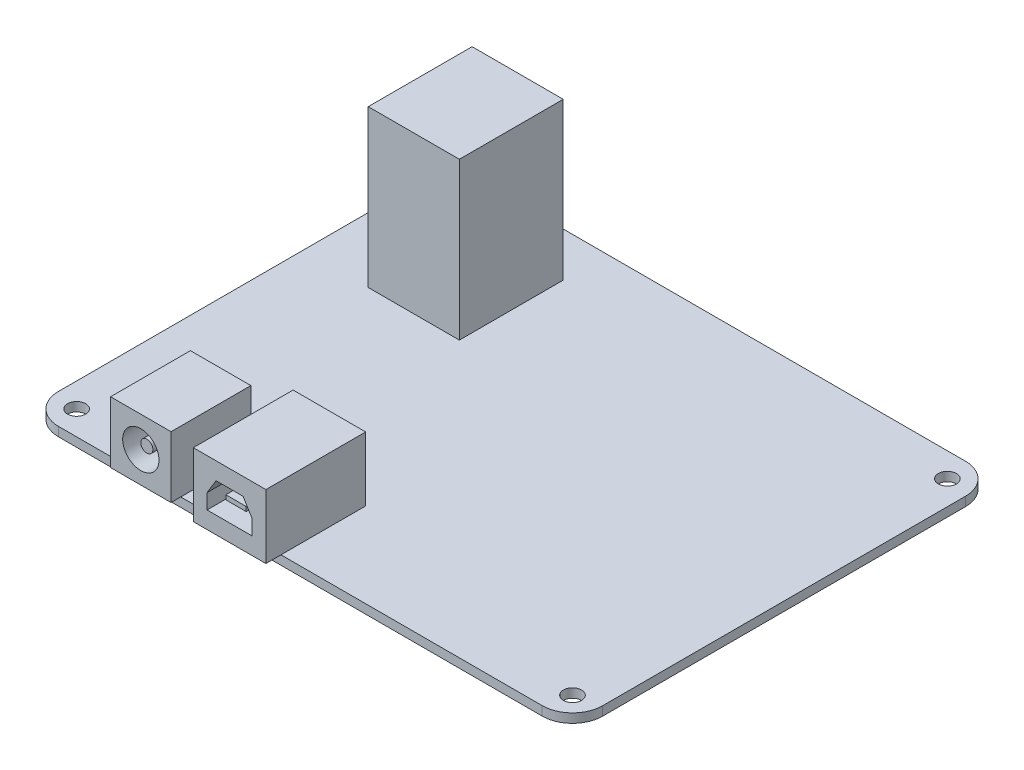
ISO-10303-21;
HEADER;
FILE_DESCRIPTION(('STEP AP214'),'2;1');
FILE_NAME('part.step','',(''),(''),'','','');
FILE_SCHEMA(('AUTOMOTIVE_DESIGN { 1 0 10303 214 1 1 1 1 }'));
ENDSEC;
DATA;
#1=APPLICATION_CONTEXT('core data for automotive mechanical design processes');
#2=APPLICATION_PROTOCOL_DEFINITION('international standard','automotive_design',2000,#1);
#3=PRODUCT_CONTEXT('',#1,'mechanical');
#4=PRODUCT('Part','Part','',(#3));
#5=PRODUCT_RELATED_PRODUCT_CATEGORY('part','',(#4));
#6=PRODUCT_DEFINITION_FORMATION('','',#4);
#7=PRODUCT_DEFINITION_CONTEXT('part definition',#1,'design');
#8=PRODUCT_DEFINITION('design','',#6,#7);
#9=PRODUCT_DEFINITION_SHAPE('','',#8);
#10=(LENGTH_UNIT() NAMED_UNIT(*) SI_UNIT(.MILLI.,.METRE.));
#11=(NAMED_UNIT(*) PLANE_ANGLE_UNIT() SI_UNIT($,.RADIAN.));
#12=(NAMED_UNIT(*) SI_UNIT($,.STERADIAN.) SOLID_ANGLE_UNIT());
#13=UNCERTAINTY_MEASURE_WITH_UNIT(LENGTH_MEASURE(1.E-05),#10,'distance_accuracy_value','');
#14=(GEOMETRIC_REPRESENTATION_CONTEXT(3) GLOBAL_UNCERTAINTY_ASSIGNED_CONTEXT((#13)) GLOBAL_UNIT_ASSIGNED_CONTEXT((#10,
#11,#12)) REPRESENTATION_CONTEXT('',''));
#15=CARTESIAN_POINT('',(0.,0.,0.));
#16=DIRECTION('',(0.,0.,1.));
#17=DIRECTION('',(1.,0.,0.));
#18=AXIS2_PLACEMENT_3D('',#15,#16,#17);
#19=CARTESIAN_POINT('',(0.,1.5,0.));
#20=DIRECTION('',(0.,1.,0.));
#21=DIRECTION('',(0.,0.,1.));
#22=AXIS2_PLACEMENT_3D('',#19,#20,#21);
#23=PLANE('',#22);
#24=CARTESIAN_POINT('',(41.,1.5,31.));
#25=DIRECTION('',(0.,1.,0.));
#26=DIRECTION('',(0.,0.,-1.));
#27=AXIS2_PLACEMENT_3D('',#24,#25,#26);
#28=CIRCLE('',#27,1.5);
#29=CARTESIAN_POINT('',(41.,1.5,29.5));
#30=VERTEX_POINT('',#29);
#31=EDGE_CURVE('E429',#30,#30,#28,.T.);
#32=ORIENTED_EDGE('',*,*,#31,.F.);
#33=EDGE_LOOP('',(#32));
#34=FACE_BOUND('',#33,.T.);
#35=CARTESIAN_POINT('',(41.,1.5,-31.));
#36=DIRECTION('',(0.,-1.,0.));
#37=DIRECTION('',(0.,0.,1.));
#38=AXIS2_PLACEMENT_3D('',#35,#36,#37);
#39=CIRCLE('',#38,1.5);
#40=CARTESIAN_POINT('',(41.,1.5,-29.5));
#41=VERTEX_POINT('',#40);
#42=EDGE_CURVE('E433',#41,#41,#39,.T.);
#43=ORIENTED_EDGE('',*,*,#42,.T.);
#44=EDGE_LOOP('',(#43));
#45=FACE_BOUND('',#44,.T.);
#46=CARTESIAN_POINT('',(-41.,1.5,31.));
#47=DIRECTION('',(0.,-1.,0.));
#48=DIRECTION('',(0.,0.,-1.));
#49=AXIS2_PLACEMENT_3D('',#46,#47,#48);
#50=CIRCLE('',#49,1.5);
#51=CARTESIAN_POINT('',(-41.,1.5,29.5));
#52=VERTEX_POINT('',#51);
#53=EDGE_CURVE('E439',#52,#52,#50,.T.);
#54=ORIENTED_EDGE('',*,*,#53,.T.);
#55=EDGE_LOOP('',(#54));
#56=FACE_BOUND('',#55,.T.);
#57=CARTESIAN_POINT('',(-41.,1.5,-31.));
#58=DIRECTION('',(0.,1.,0.));
#59=DIRECTION('',(0.,0.,1.));
#60=AXIS2_PLACEMENT_3D('',#57,#58,#59);
#61=CIRCLE('',#60,1.5);
#62=CARTESIAN_POINT('',(-41.,1.5,-29.5));
#63=VERTEX_POINT('',#62);
#64=EDGE_CURVE('E445',#63,#63,#61,.T.);
#65=ORIENTED_EDGE('',*,*,#64,.F.);
#66=EDGE_LOOP('',(#65));
#67=FACE_BOUND('',#66,.T.);
#68=DIRECTION('',(1.,0.,0.));
#69=VECTOR('',#68,1.);
#70=CARTESIAN_POINT('',(-45.,1.5,35.));
#71=LINE('',#70,#69);
#72=CARTESIAN_POINT('',(-19.78,1.5,35.));
#73=VERTEX_POINT('',#72);
#74=CARTESIAN_POINT('',(-15.2,1.5,35.));
#75=VERTEX_POINT('',#74);
#76=EDGE_CURVE('E543',#73,#75,#71,.T.);
#77=ORIENTED_EDGE('',*,*,#76,.T.);
#78=DIRECTION('',(0.,0.,1.));
#79=VECTOR('',#78,1.);
#80=CARTESIAN_POINT('',(-15.2,1.5,21.));
#81=LINE('',#80,#79);
#82=CARTESIAN_POINT('',(-15.2,1.5,21.));
#83=VERTEX_POINT('',#82);
#84=EDGE_CURVE('E365',#83,#75,#81,.T.);
#85=ORIENTED_EDGE('',*,*,#84,.F.);
#86=DIRECTION('',(-1.,0.,0.));
#87=VECTOR('',#86,1.);
#88=CARTESIAN_POINT('',(-15.2,1.5,21.));
#89=LINE('',#88,#87);
#90=CARTESIAN_POINT('',(-3.2,1.5,21.));
#91=VERTEX_POINT('',#90);
#92=EDGE_CURVE('E358',#91,#83,#89,.T.);
#93=ORIENTED_EDGE('',*,*,#92,.F.);
#94=DIRECTION('',(0.,0.,1.));
#95=VECTOR('',#94,1.);
#96=CARTESIAN_POINT('',(-3.2,1.5,0.));
#97=LINE('',#96,#95);
#98=CARTESIAN_POINT('',(-3.2,1.5,35.));
#99=VERTEX_POINT('',#98);
#100=EDGE_CURVE('E11',#91,#99,#97,.T.);
#101=ORIENTED_EDGE('',*,*,#100,.T.);
#102=CARTESIAN_POINT('',(40.,1.5,35.));
#103=VERTEX_POINT('',#102);
#104=EDGE_CURVE('E464',#99,#103,#71,.T.);
#105=ORIENTED_EDGE('',*,*,#104,.T.);
#106=CARTESIAN_POINT('',(40.,1.5,30.));
#107=DIRECTION('',(0.,1.,0.));
#108=DIRECTION('',(0.,0.,1.));
#109=AXIS2_PLACEMENT_3D('',#106,#107,#108);
#110=CIRCLE('',#109,5.);
#111=CARTESIAN_POINT('',(45.,1.5,30.));
#112=VERTEX_POINT('',#111);
#113=EDGE_CURVE('E497',#103,#112,#110,.T.);
#114=ORIENTED_EDGE('',*,*,#113,.T.);
#115=DIRECTION('',(0.,0.,-1.));
#116=VECTOR('',#115,1.);
#117=CARTESIAN_POINT('',(45.,1.5,-35.));
#118=LINE('',#117,#116);
#119=CARTESIAN_POINT('',(45.,1.5,-30.));
#120=VERTEX_POINT('',#119);
#121=EDGE_CURVE('E454',#112,#120,#118,.T.);
#122=ORIENTED_EDGE('',*,*,#121,.T.);
#123=CARTESIAN_POINT('',(40.,1.5,-30.));
#124=DIRECTION('',(0.,1.,0.));
#125=DIRECTION('',(0.,0.,1.));
#126=AXIS2_PLACEMENT_3D('',#123,#124,#125);
#127=CIRCLE('',#126,5.);
#128=CARTESIAN_POINT('',(40.,1.5,-35.));
#129=VERTEX_POINT('',#128);
#130=EDGE_CURVE('E499',#120,#129,#127,.T.);
#131=ORIENTED_EDGE('',*,*,#130,.T.);
#132=DIRECTION('',(-1.,0.,0.));
#133=VECTOR('',#132,1.);
#134=CARTESIAN_POINT('',(-45.,1.5,-35.));
#135=LINE('',#134,#133);
#136=CARTESIAN_POINT('',(-40.,1.5,-35.));
#137=VERTEX_POINT('',#136);
#138=EDGE_CURVE('E457',#129,#137,#135,.T.);
#139=ORIENTED_EDGE('',*,*,#138,.T.);
#140=CARTESIAN_POINT('',(-40.,1.5,-30.));
#141=DIRECTION('',(0.,1.,0.));
#142=DIRECTION('',(0.,0.,1.));
#143=AXIS2_PLACEMENT_3D('',#140,#141,#142);
#144=CIRCLE('',#143,5.);
#145=CARTESIAN_POINT('',(-45.,1.5,-30.));
#146=VERTEX_POINT('',#145);
#147=EDGE_CURVE('E503',#137,#146,#144,.T.);
#148=ORIENTED_EDGE('',*,*,#147,.T.);
#149=DIRECTION('',(0.,0.,1.));
#150=VECTOR('',#149,1.);
#151=CARTESIAN_POINT('',(-45.,1.5,-35.));
#152=LINE('',#151,#150);
#153=CARTESIAN_POINT('',(-45.,1.5,30.));
#154=VERTEX_POINT('',#153);
#155=EDGE_CURVE('E461',#146,#154,#152,.T.);
#156=ORIENTED_EDGE('',*,*,#155,.T.);
#157=CARTESIAN_POINT('',(-40.,1.5,30.));
#158=DIRECTION('',(0.,1.,0.));
#159=DIRECTION('',(0.,0.,1.));
#160=AXIS2_PLACEMENT_3D('',#157,#158,#159);
#161=CIRCLE('',#160,5.);
#162=CARTESIAN_POINT('',(-40.,1.5,35.));
#163=VERTEX_POINT('',#162);
#164=EDGE_CURVE('E501',#154,#163,#161,.T.);
#165=ORIENTED_EDGE('',*,*,#164,.T.);
#166=CARTESIAN_POINT('',(-29.78,1.5,35.));
#167=VERTEX_POINT('',#166);
#168=EDGE_CURVE('E465',#163,#167,#71,.T.);
#169=ORIENTED_EDGE('',*,*,#168,.T.);
#170=DIRECTION('',(0.,0.,1.));
#171=VECTOR('',#170,1.);
#172=CARTESIAN_POINT('',(-29.78,1.5,23.4));
#173=LINE('',#172,#171);
#174=CARTESIAN_POINT('',(-29.78,1.5,23.4));
#175=VERTEX_POINT('',#174);
#176=EDGE_CURVE('E408',#175,#167,#173,.T.);
#177=ORIENTED_EDGE('',*,*,#176,.F.);
#178=DIRECTION('',(-1.,0.,0.));
#179=VECTOR('',#178,1.);
#180=CARTESIAN_POINT('',(-29.78,1.5,23.4));
#181=LINE('',#180,#179);
#182=CARTESIAN_POINT('',(-19.78,1.5,23.4));
#183=VERTEX_POINT('',#182);
#184=EDGE_CURVE('E401',#183,#175,#181,.T.);
#185=ORIENTED_EDGE('',*,*,#184,.F.);
#186=DIRECTION('',(0.,0.,-1.));
#187=VECTOR('',#186,1.);
#188=CARTESIAN_POINT('',(-19.78,1.5,23.4));
#189=LINE('',#188,#187);
#190=EDGE_CURVE('E47',#73,#183,#189,.T.);
#191=ORIENTED_EDGE('',*,*,#190,.F.);
#192=EDGE_LOOP('',(#77,#85,#93,#101,#105,#114,#122,#131,#139,#148,#156,#165,#169,#177,#185,#191));
#193=FACE_BOUND('',#192,.T.);
#194=DIRECTION('',(1.,0.,0.));
#195=VECTOR('',#194,1.);
#196=CARTESIAN_POINT('',(-34.2731776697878,1.5,-10.4984887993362));
#197=LINE('',#196,#195);
#198=CARTESIAN_POINT('',(-34.2731776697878,1.5,-10.4984887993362));
#199=VERTEX_POINT('',#198);
#200=CARTESIAN_POINT('',(-19.2027023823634,1.5,-10.4984887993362));
#201=VERTEX_POINT('',#200);
#202=EDGE_CURVE('E1139',#199,#201,#197,.T.);
#203=ORIENTED_EDGE('',*,*,#202,.F.);
#204=DIRECTION('',(0.,0.,1.));
#205=VECTOR('',#204,1.);
#206=CARTESIAN_POINT('',(-34.2731776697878,1.5,-27.6755896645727));
#207=LINE('',#206,#205);
#208=CARTESIAN_POINT('',(-34.2731776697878,1.5,-27.6755896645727));
#209=VERTEX_POINT('',#208);
#210=EDGE_CURVE('E272',#209,#199,#207,.T.);
#211=ORIENTED_EDGE('',*,*,#210,.F.);
#212=DIRECTION('',(-1.,0.,0.));
#213=VECTOR('',#212,1.);
#214=CARTESIAN_POINT('',(-34.2731776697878,1.5,-27.6755896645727));
#215=LINE('',#214,#213);
#216=CARTESIAN_POINT('',(-19.2027023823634,1.5,-27.6755896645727));
#217=VERTEX_POINT('',#216);
#218=EDGE_CURVE('E268',#217,#209,#215,.T.);
#219=ORIENTED_EDGE('',*,*,#218,.F.);
#220=DIRECTION('',(0.,0.,-1.));
#221=VECTOR('',#220,1.);
#222=CARTESIAN_POINT('',(-19.2027023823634,1.5,-27.6755896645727));
#223=LINE('',#222,#221);
#224=EDGE_CURVE('E1136',#201,#217,#223,.T.);
#225=ORIENTED_EDGE('',*,*,#224,.F.);
#226=EDGE_LOOP('',(#203,#211,#219,#225));
#227=FACE_BOUND('',#226,.T.);
#228=ADVANCED_FACE('F39',(#34,#45,#56,#67,#193,#227),#23,.T.);
#229=CARTESIAN_POINT('',(0.,0.,32.5));
#230=DIRECTION('',(0.,0.,1.));
#231=DIRECTION('',(1.,0.,0.));
#232=AXIS2_PLACEMENT_3D('',#229,#230,#231);
#233=PLANE('',#232);
#234=DIRECTION('',(-0.519476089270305,-0.854484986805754,0.));
#235=VECTOR('',#234,1.);
#236=CARTESIAN_POINT('',(-11.4377720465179,9.24798996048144,32.5));
#237=LINE('',#236,#235);
#238=CARTESIAN_POINT('',(-11.4377720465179,9.24798996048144,32.5));
#239=VERTEX_POINT('',#238);
#240=CARTESIAN_POINT('',(-12.9260044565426,6.8,32.5));
#241=VERTEX_POINT('',#240);
#242=EDGE_CURVE('E306',#239,#241,#237,.T.);
#243=ORIENTED_EDGE('',*,*,#242,.T.);
#244=DIRECTION('',(0.,-1.,0.));
#245=VECTOR('',#244,1.);
#246=CARTESIAN_POINT('',(-12.9260044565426,6.8,32.5));
#247=LINE('',#246,#245);
#248=CARTESIAN_POINT('',(-12.9260044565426,4.31556254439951,32.5));
#249=VERTEX_POINT('',#248);
#250=EDGE_CURVE('E309',#241,#249,#247,.T.);
#251=ORIENTED_EDGE('',*,*,#250,.T.);
#252=DIRECTION('',(1.,0.,0.));
#253=VECTOR('',#252,1.);
#254=CARTESIAN_POINT('',(-12.9260044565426,4.31556254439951,32.5));
#255=LINE('',#254,#253);
#256=CARTESIAN_POINT('',(-5.47399554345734,4.31556254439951,32.5));
#257=VERTEX_POINT('',#256);
#258=EDGE_CURVE('E313',#249,#257,#255,.T.);
#259=ORIENTED_EDGE('',*,*,#258,.T.);
#260=DIRECTION('',(0.,1.,0.));
#261=VECTOR('',#260,1.);
#262=CARTESIAN_POINT('',(-5.47399554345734,6.8,32.5));
#263=LINE('',#262,#261);
#264=CARTESIAN_POINT('',(-5.47399554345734,6.8,32.5));
#265=VERTEX_POINT('',#264);
#266=EDGE_CURVE('E316',#257,#265,#263,.T.);
#267=ORIENTED_EDGE('',*,*,#266,.T.);
#268=DIRECTION('',(-0.519476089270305,0.854484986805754,0.));
#269=VECTOR('',#268,1.);
#270=CARTESIAN_POINT('',(-6.96222795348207,9.24798996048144,32.5));
#271=LINE('',#270,#269);
#272=CARTESIAN_POINT('',(-6.96222795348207,9.24798996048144,32.5));
#273=VERTEX_POINT('',#272);
#274=EDGE_CURVE('E319',#265,#273,#271,.T.);
#275=ORIENTED_EDGE('',*,*,#274,.T.);
#276=DIRECTION('',(-1.,0.,0.));
#277=VECTOR('',#276,1.);
#278=CARTESIAN_POINT('',(-6.96222795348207,9.24798996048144,32.5));
#279=LINE('',#278,#277);
#280=EDGE_CURVE('E322',#273,#239,#279,.T.);
#281=ORIENTED_EDGE('',*,*,#280,.T.);
#282=EDGE_LOOP('',(#243,#251,#259,#267,#275,#281));
#283=FACE_BOUND('',#282,.T.);
#284=DIRECTION('',(1.,0.,0.));
#285=VECTOR('',#284,1.);
#286=CARTESIAN_POINT('',(-10.8214533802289,6.31565803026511,32.5));
#287=LINE('',#286,#285);
#288=CARTESIAN_POINT('',(-10.8214533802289,6.31565803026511,32.5));
#289=VERTEX_POINT('',#288);
#290=CARTESIAN_POINT('',(-7.45279679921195,6.31565803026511,32.5));
#291=VERTEX_POINT('',#290);
#292=EDGE_CURVE('E277',#289,#291,#287,.T.);
#293=ORIENTED_EDGE('',*,*,#292,.F.);
#294=DIRECTION('',(0.,-1.,0.));
#295=VECTOR('',#294,1.);
#296=CARTESIAN_POINT('',(-10.8214533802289,7.04797467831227,32.5));
#297=LINE('',#296,#295);
#298=CARTESIAN_POINT('',(-10.8214533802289,7.04797467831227,32.5));
#299=VERTEX_POINT('',#298);
#300=EDGE_CURVE('E274',#299,#289,#297,.T.);
#301=ORIENTED_EDGE('',*,*,#300,.F.);
#302=DIRECTION('',(-1.,0.,0.));
#303=VECTOR('',#302,1.);
#304=CARTESIAN_POINT('',(-10.8214533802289,7.04797467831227,32.5));
#305=LINE('',#304,#303);
#306=CARTESIAN_POINT('',(-7.45279679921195,7.04797467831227,32.5));
#307=VERTEX_POINT('',#306);
#308=EDGE_CURVE('E286',#307,#299,#305,.T.);
#309=ORIENTED_EDGE('',*,*,#308,.F.);
#310=DIRECTION('',(0.,1.,0.));
#311=VECTOR('',#310,1.);
#312=CARTESIAN_POINT('',(-7.45279679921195,7.04797467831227,32.5));
#313=LINE('',#312,#311);
#314=EDGE_CURVE('E294',#291,#307,#313,.T.);
#315=ORIENTED_EDGE('',*,*,#314,.F.);
#316=EDGE_LOOP('',(#293,#301,#309,#315));
#317=FACE_BOUND('',#316,.T.);
#318=ADVANCED_FACE('F599',(#283,#317),#233,.T.);
#319=CARTESIAN_POINT('',(45.,1.5,-35.));
#320=DIRECTION('',(-1.,0.,0.));
#321=DIRECTION('',(0.,0.,1.));
#322=AXIS2_PLACEMENT_3D('',#319,#320,#321);
#323=PLANE('',#322);
#324=DIRECTION('',(0.,0.,-1.));
#325=VECTOR('',#324,1.);
#326=CARTESIAN_POINT('',(45.,0.,-35.));
#327=LINE('',#326,#325);
#328=CARTESIAN_POINT('',(45.,0.,30.));
#329=VERTEX_POINT('',#328);
#330=CARTESIAN_POINT('',(45.,0.,-30.));
#331=VERTEX_POINT('',#330);
#332=EDGE_CURVE('E451',#329,#331,#327,.T.);
#333=ORIENTED_EDGE('',*,*,#332,.T.);
#334=DIRECTION('',(0.,-1.,0.));
#335=VECTOR('',#334,1.);
#336=CARTESIAN_POINT('',(45.,1.5,-30.));
#337=LINE('',#336,#335);
#338=EDGE_CURVE('E513',#331,#120,#337,.F.);
#339=ORIENTED_EDGE('',*,*,#338,.T.);
#340=ORIENTED_EDGE('',*,*,#121,.F.);
#341=DIRECTION('',(0.,-1.,0.));
#342=VECTOR('',#341,1.);
#343=CARTESIAN_POINT('',(45.,1.5,30.));
#344=LINE('',#343,#342);
#345=EDGE_CURVE('E511',#112,#329,#344,.T.);
#346=ORIENTED_EDGE('',*,*,#345,.T.);
#347=EDGE_LOOP('',(#333,#339,#340,#346));
#348=FACE_BOUND('',#347,.T.);
#349=ADVANCED_FACE('F560',(#348),#323,.F.);
#350=CARTESIAN_POINT('',(-45.,1.5,-35.));
#351=DIRECTION('',(0.,0.,1.));
#352=DIRECTION('',(1.,0.,0.));
#353=AXIS2_PLACEMENT_3D('',#350,#351,#352);
#354=PLANE('',#353);
#355=DIRECTION('',(-1.,0.,0.));
#356=VECTOR('',#355,1.);
#357=CARTESIAN_POINT('',(-45.,0.,-35.));
#358=LINE('',#357,#356);
#359=CARTESIAN_POINT('',(40.,0.,-35.));
#360=VERTEX_POINT('',#359);
#361=CARTESIAN_POINT('',(-40.,0.,-35.));
#362=VERTEX_POINT('',#361);
#363=EDGE_CURVE('E472',#360,#362,#358,.T.);
#364=ORIENTED_EDGE('',*,*,#363,.T.);
#365=DIRECTION('',(0.,-1.,0.));
#366=VECTOR('',#365,1.);
#367=CARTESIAN_POINT('',(-40.,1.5,-35.));
#368=LINE('',#367,#366);
#369=EDGE_CURVE('E495',#362,#137,#368,.F.);
#370=ORIENTED_EDGE('',*,*,#369,.T.);
#371=ORIENTED_EDGE('',*,*,#138,.F.);
#372=DIRECTION('',(0.,-1.,0.));
#373=VECTOR('',#372,1.);
#374=CARTESIAN_POINT('',(40.,1.5,-35.));
#375=LINE('',#374,#373);
#376=EDGE_CURVE('E492',#129,#360,#375,.T.);
#377=ORIENTED_EDGE('',*,*,#376,.T.);
#378=EDGE_LOOP('',(#364,#370,#371,#377));
#379=FACE_BOUND('',#378,.T.);
#380=ADVANCED_FACE('F571',(#379),#354,.F.);
#381=CARTESIAN_POINT('',(-45.,1.5,-35.));
#382=DIRECTION('',(1.,0.,0.));
#383=DIRECTION('',(0.,0.,-1.));
#384=AXIS2_PLACEMENT_3D('',#381,#382,#383);
#385=PLANE('',#384);
#386=ORIENTED_EDGE('',*,*,#155,.F.);
#387=DIRECTION('',(0.,-1.,0.));
#388=VECTOR('',#387,1.);
#389=CARTESIAN_POINT('',(-45.,1.5,-30.));
#390=LINE('',#389,#388);
#391=CARTESIAN_POINT('',(-45.,0.,-30.));
#392=VERTEX_POINT('',#391);
#393=EDGE_CURVE('E481',#146,#392,#390,.T.);
#394=ORIENTED_EDGE('',*,*,#393,.T.);
#395=DIRECTION('',(0.,0.,1.));
#396=VECTOR('',#395,1.);
#397=CARTESIAN_POINT('',(-45.,0.,-35.));
#398=LINE('',#397,#396);
#399=CARTESIAN_POINT('',(-45.,0.,30.));
#400=VERTEX_POINT('',#399);
#401=EDGE_CURVE('E475',#392,#400,#398,.T.);
#402=ORIENTED_EDGE('',*,*,#401,.T.);
#403=DIRECTION('',(0.,-1.,0.));
#404=VECTOR('',#403,1.);
#405=CARTESIAN_POINT('',(-45.,1.5,30.));
#406=LINE('',#405,#404);
#407=EDGE_CURVE('E468',#400,#154,#406,.F.);
#408=ORIENTED_EDGE('',*,*,#407,.T.);
#409=EDGE_LOOP('',(#386,#394,#402,#408));
#410=FACE_BOUND('',#409,.T.);
#411=ADVANCED_FACE('F579',(#410),#385,.F.);
#412=CARTESIAN_POINT('',(-45.,1.5,35.));
#413=DIRECTION('',(0.,0.,-1.));
#414=DIRECTION('',(-1.,0.,0.));
#415=AXIS2_PLACEMENT_3D('',#412,#413,#414);
#416=PLANE('',#415);
#417=ORIENTED_EDGE('',*,*,#168,.F.);
#418=DIRECTION('',(0.,-1.,0.));
#419=VECTOR('',#418,1.);
#420=CARTESIAN_POINT('',(-40.,1.5,35.));
#421=LINE('',#420,#419);
#422=CARTESIAN_POINT('',(-40.,0.,35.));
#423=VERTEX_POINT('',#422);
#424=EDGE_CURVE('E508',#163,#423,#421,.T.);
#425=ORIENTED_EDGE('',*,*,#424,.T.);
#426=DIRECTION('',(1.,0.,0.));
#427=VECTOR('',#426,1.);
#428=CARTESIAN_POINT('',(-45.,0.,35.));
#429=LINE('',#428,#427);
#430=CARTESIAN_POINT('',(40.,0.,35.));
#431=VERTEX_POINT('',#430);
#432=EDGE_CURVE('E458',#423,#431,#429,.T.);
#433=ORIENTED_EDGE('',*,*,#432,.T.);
#434=DIRECTION('',(0.,-1.,0.));
#435=VECTOR('',#434,1.);
#436=CARTESIAN_POINT('',(40.,1.5,35.));
#437=LINE('',#436,#435);
#438=EDGE_CURVE('E505',#431,#103,#437,.F.);
#439=ORIENTED_EDGE('',*,*,#438,.T.);
#440=ORIENTED_EDGE('',*,*,#104,.F.);
#441=EDGE_CURVE('E544',#75,#99,#71,.T.);
#442=ORIENTED_EDGE('',*,*,#441,.F.);
#443=ORIENTED_EDGE('',*,*,#76,.F.);
#444=EDGE_CURVE('E469',#167,#73,#71,.T.);
#445=ORIENTED_EDGE('',*,*,#444,.F.);
#446=EDGE_LOOP('',(#417,#425,#433,#439,#440,#442,#443,#445));
#447=FACE_BOUND('',#446,.T.);
#448=ADVANCED_FACE('F555',(#447),#416,.F.);
#449=CARTESIAN_POINT('',(0.,0.,0.));
#450=DIRECTION('',(0.,1.,0.));
#451=DIRECTION('',(0.,0.,1.));
#452=AXIS2_PLACEMENT_3D('',#449,#450,#451);
#453=PLANE('',#452);
#454=CARTESIAN_POINT('',(41.,0.,31.));
#455=DIRECTION('',(0.,1.,0.));
#456=DIRECTION('',(0.,0.,-1.));
#457=AXIS2_PLACEMENT_3D('',#454,#455,#456);
#458=CIRCLE('',#457,1.5);
#459=CARTESIAN_POINT('',(41.,0.,29.5));
#460=VERTEX_POINT('',#459);
#461=EDGE_CURVE('E430',#460,#460,#458,.T.);
#462=ORIENTED_EDGE('',*,*,#461,.T.);
#463=EDGE_LOOP('',(#462));
#464=FACE_BOUND('',#463,.T.);
#465=CARTESIAN_POINT('',(41.,0.,-31.));
#466=DIRECTION('',(0.,-1.,0.));
#467=DIRECTION('',(0.,0.,1.));
#468=AXIS2_PLACEMENT_3D('',#465,#466,#467);
#469=CIRCLE('',#468,1.5);
#470=CARTESIAN_POINT('',(41.,0.,-29.5));
#471=VERTEX_POINT('',#470);
#472=EDGE_CURVE('E436',#471,#471,#469,.T.);
#473=ORIENTED_EDGE('',*,*,#472,.F.);
#474=EDGE_LOOP('',(#473));
#475=FACE_BOUND('',#474,.T.);
#476=CARTESIAN_POINT('',(-41.,0.,31.));
#477=DIRECTION('',(0.,-1.,0.));
#478=DIRECTION('',(0.,0.,-1.));
#479=AXIS2_PLACEMENT_3D('',#476,#477,#478);
#480=CIRCLE('',#479,1.5);
#481=CARTESIAN_POINT('',(-41.,0.,29.5));
#482=VERTEX_POINT('',#481);
#483=EDGE_CURVE('E442',#482,#482,#480,.T.);
#484=ORIENTED_EDGE('',*,*,#483,.F.);
#485=EDGE_LOOP('',(#484));
#486=FACE_BOUND('',#485,.T.);
#487=CARTESIAN_POINT('',(-41.,0.,-31.));
#488=DIRECTION('',(0.,1.,0.));
#489=DIRECTION('',(0.,0.,1.));
#490=AXIS2_PLACEMENT_3D('',#487,#488,#489);
#491=CIRCLE('',#490,1.5);
#492=CARTESIAN_POINT('',(-41.,0.,-29.5));
#493=VERTEX_POINT('',#492);
#494=EDGE_CURVE('E448',#493,#493,#491,.T.);
#495=ORIENTED_EDGE('',*,*,#494,.T.);
#496=EDGE_LOOP('',(#495));
#497=FACE_BOUND('',#496,.T.);
#498=ORIENTED_EDGE('',*,*,#401,.F.);
#499=CARTESIAN_POINT('',(-40.,0.,-30.));
#500=DIRECTION('',(0.,1.,0.));
#501=DIRECTION('',(0.,0.,1.));
#502=AXIS2_PLACEMENT_3D('',#499,#500,#501);
#503=CIRCLE('',#502,5.);
#504=EDGE_CURVE('E490',#392,#362,#503,.F.);
#505=ORIENTED_EDGE('',*,*,#504,.T.);
#506=ORIENTED_EDGE('',*,*,#363,.F.);
#507=CARTESIAN_POINT('',(40.,0.,-30.));
#508=DIRECTION('',(0.,1.,0.));
#509=DIRECTION('',(0.,0.,1.));
#510=AXIS2_PLACEMENT_3D('',#507,#508,#509);
#511=CIRCLE('',#510,5.);
#512=EDGE_CURVE('E486',#360,#331,#511,.F.);
#513=ORIENTED_EDGE('',*,*,#512,.T.);
#514=ORIENTED_EDGE('',*,*,#332,.F.);
#515=CARTESIAN_POINT('',(40.,0.,30.));
#516=DIRECTION('',(0.,1.,0.));
#517=DIRECTION('',(0.,0.,1.));
#518=AXIS2_PLACEMENT_3D('',#515,#516,#517);
#519=CIRCLE('',#518,5.);
#520=EDGE_CURVE('E484',#329,#431,#519,.F.);
#521=ORIENTED_EDGE('',*,*,#520,.T.);
#522=ORIENTED_EDGE('',*,*,#432,.F.);
#523=CARTESIAN_POINT('',(-40.,0.,30.));
#524=DIRECTION('',(0.,1.,0.));
#525=DIRECTION('',(0.,0.,1.));
#526=AXIS2_PLACEMENT_3D('',#523,#524,#525);
#527=CIRCLE('',#526,5.);
#528=EDGE_CURVE('E488',#423,#400,#527,.F.);
#529=ORIENTED_EDGE('',*,*,#528,.T.);
#530=EDGE_LOOP('',(#498,#505,#506,#513,#514,#521,#522,#529));
#531=FACE_BOUND('',#530,.T.);
#532=ADVANCED_FACE('F563',(#464,#475,#486,#497,#531),#453,.F.);
#533=CARTESIAN_POINT('',(-40.,1.5,-30.));
#534=DIRECTION('',(0.,-1.,0.));
#535=DIRECTION('',(0.,0.,-1.));
#536=AXIS2_PLACEMENT_3D('',#533,#534,#535);
#537=CYLINDRICAL_SURFACE('',#536,5.);
#538=ORIENTED_EDGE('',*,*,#147,.F.);
#539=ORIENTED_EDGE('',*,*,#369,.F.);
#540=ORIENTED_EDGE('',*,*,#504,.F.);
#541=ORIENTED_EDGE('',*,*,#393,.F.);
#542=EDGE_LOOP('',(#538,#539,#540,#541));
#543=FACE_BOUND('',#542,.T.);
#544=ADVANCED_FACE('F577',(#543),#537,.T.);
#545=CARTESIAN_POINT('',(-40.,1.5,30.));
#546=DIRECTION('',(0.,-1.,0.));
#547=DIRECTION('',(0.,0.,-1.));
#548=AXIS2_PLACEMENT_3D('',#545,#546,#547);
#549=CYLINDRICAL_SURFACE('',#548,5.);
#550=ORIENTED_EDGE('',*,*,#164,.F.);
#551=ORIENTED_EDGE('',*,*,#407,.F.);
#552=ORIENTED_EDGE('',*,*,#528,.F.);
#553=ORIENTED_EDGE('',*,*,#424,.F.);
#554=EDGE_LOOP('',(#550,#551,#552,#553));
#555=FACE_BOUND('',#554,.T.);
#556=ADVANCED_FACE('F584',(#555),#549,.T.);
#557=CARTESIAN_POINT('',(40.,1.5,-30.));
#558=DIRECTION('',(0.,-1.,0.));
#559=DIRECTION('',(0.,0.,-1.));
#560=AXIS2_PLACEMENT_3D('',#557,#558,#559);
#561=CYLINDRICAL_SURFACE('',#560,5.);
#562=ORIENTED_EDGE('',*,*,#130,.F.);
#563=ORIENTED_EDGE('',*,*,#338,.F.);
#564=ORIENTED_EDGE('',*,*,#512,.F.);
#565=ORIENTED_EDGE('',*,*,#376,.F.);
#566=EDGE_LOOP('',(#562,#563,#564,#565));
#567=FACE_BOUND('',#566,.T.);
#568=ADVANCED_FACE('F568',(#567),#561,.T.);
#569=CARTESIAN_POINT('',(40.,1.5,30.));
#570=DIRECTION('',(0.,-1.,0.));
#571=DIRECTION('',(0.,0.,-1.));
#572=AXIS2_PLACEMENT_3D('',#569,#570,#571);
#573=CYLINDRICAL_SURFACE('',#572,5.);
#574=ORIENTED_EDGE('',*,*,#113,.F.);
#575=ORIENTED_EDGE('',*,*,#438,.F.);
#576=ORIENTED_EDGE('',*,*,#520,.F.);
#577=ORIENTED_EDGE('',*,*,#345,.F.);
#578=EDGE_LOOP('',(#574,#575,#576,#577));
#579=FACE_BOUND('',#578,.T.);
#580=ADVANCED_FACE('F41',(#579),#573,.T.);
#581=CARTESIAN_POINT('',(-41.,0.,-31.));
#582=DIRECTION('',(0.,1.,0.));
#583=DIRECTION('',(0.,0.,1.));
#584=AXIS2_PLACEMENT_3D('',#581,#582,#583);
#585=CYLINDRICAL_SURFACE('',#584,1.5);
#586=ORIENTED_EDGE('',*,*,#494,.F.);
#587=EDGE_LOOP('',(#586));
#588=FACE_BOUND('',#587,.T.);
#589=ORIENTED_EDGE('',*,*,#64,.T.);
#590=EDGE_LOOP('',(#589));
#591=FACE_BOUND('',#590,.T.);
#592=ADVANCED_FACE('F613',(#588,#591),#585,.F.);
#593=CARTESIAN_POINT('',(-41.,0.,31.));
#594=DIRECTION('',(0.,1.,0.));
#595=DIRECTION('',(0.,0.,1.));
#596=AXIS2_PLACEMENT_3D('',#593,#594,#595);
#597=CYLINDRICAL_SURFACE('',#596,1.5);
#598=ORIENTED_EDGE('',*,*,#483,.T.);
#599=EDGE_LOOP('',(#598));
#600=FACE_BOUND('',#599,.T.);
#601=ORIENTED_EDGE('',*,*,#53,.F.);
#602=EDGE_LOOP('',(#601));
#603=FACE_BOUND('',#602,.T.);
#604=ADVANCED_FACE('F636',(#600,#603),#597,.F.);
#605=CARTESIAN_POINT('',(41.,0.,-31.));
#606=DIRECTION('',(0.,1.,0.));
#607=DIRECTION('',(0.,0.,1.));
#608=AXIS2_PLACEMENT_3D('',#605,#606,#607);
#609=CYLINDRICAL_SURFACE('',#608,1.5);
#610=ORIENTED_EDGE('',*,*,#472,.T.);
#611=EDGE_LOOP('',(#610));
#612=FACE_BOUND('',#611,.T.);
#613=ORIENTED_EDGE('',*,*,#42,.F.);
#614=EDGE_LOOP('',(#613));
#615=FACE_BOUND('',#614,.T.);
#616=ADVANCED_FACE('F641',(#612,#615),#609,.F.);
#617=CARTESIAN_POINT('',(41.,0.,31.));
#618=DIRECTION('',(0.,1.,0.));
#619=DIRECTION('',(0.,0.,1.));
#620=AXIS2_PLACEMENT_3D('',#617,#618,#619);
#621=CYLINDRICAL_SURFACE('',#620,1.5);
#622=ORIENTED_EDGE('',*,*,#461,.F.);
#623=EDGE_LOOP('',(#622));
#624=FACE_BOUND('',#623,.T.);
#625=ORIENTED_EDGE('',*,*,#31,.T.);
#626=EDGE_LOOP('',(#625));
#627=FACE_BOUND('',#626,.T.);
#628=ADVANCED_FACE('F651',(#624,#627),#621,.F.);
#629=CARTESIAN_POINT('',(0.,1.5,0.));
#630=DIRECTION('',(0.,1.,0.));
#631=DIRECTION('',(0.,0.,1.));
#632=AXIS2_PLACEMENT_3D('',#629,#630,#631);
#633=PLANE('',#632);
#634=CARTESIAN_POINT('',(-29.78,1.5,36.6));
#635=VERTEX_POINT('',#634);
#636=EDGE_CURVE('E394',#167,#635,#173,.T.);
#637=ORIENTED_EDGE('',*,*,#636,.F.);
#638=ORIENTED_EDGE('',*,*,#444,.T.);
#639=CARTESIAN_POINT('',(-19.78,1.5,36.6));
#640=VERTEX_POINT('',#639);
#641=EDGE_CURVE('E413',#640,#73,#189,.T.);
#642=ORIENTED_EDGE('',*,*,#641,.F.);
#643=DIRECTION('',(1.,0.,0.));
#644=VECTOR('',#643,1.);
#645=CARTESIAN_POINT('',(-29.78,1.5,36.6));
#646=LINE('',#645,#644);
#647=EDGE_CURVE('E411',#635,#640,#646,.T.);
#648=ORIENTED_EDGE('',*,*,#647,.F.);
#649=EDGE_LOOP('',(#637,#638,#642,#648));
#650=FACE_BOUND('',#649,.T.);
#651=ADVANCED_FACE('F540',(#650),#633,.F.);
#652=CARTESIAN_POINT('',(-29.78,11.65,23.4));
#653=DIRECTION('',(1.,0.,0.));
#654=DIRECTION('',(0.,0.,-1.));
#655=AXIS2_PLACEMENT_3D('',#652,#653,#654);
#656=PLANE('',#655);
#657=ORIENTED_EDGE('',*,*,#176,.T.);
#658=ORIENTED_EDGE('',*,*,#636,.T.);
#659=DIRECTION('',(0.,-1.,0.));
#660=VECTOR('',#659,1.);
#661=CARTESIAN_POINT('',(-29.78,11.65,36.6));
#662=LINE('',#661,#660);
#663=CARTESIAN_POINT('',(-29.78,11.65,36.6));
#664=VERTEX_POINT('',#663);
#665=EDGE_CURVE('E426',#664,#635,#662,.T.);
#666=ORIENTED_EDGE('',*,*,#665,.F.);
#667=DIRECTION('',(0.,0.,1.));
#668=VECTOR('',#667,1.);
#669=CARTESIAN_POINT('',(-29.78,11.65,23.4));
#670=LINE('',#669,#668);
#671=CARTESIAN_POINT('',(-29.78,11.65,23.4));
#672=VERTEX_POINT('',#671);
#673=EDGE_CURVE('E397',#672,#664,#670,.T.);
#674=ORIENTED_EDGE('',*,*,#673,.F.);
#675=DIRECTION('',(0.,-1.,0.));
#676=VECTOR('',#675,1.);
#677=CARTESIAN_POINT('',(-29.78,11.65,23.4));
#678=LINE('',#677,#676);
#679=EDGE_CURVE('E407',#672,#175,#678,.T.);
#680=ORIENTED_EDGE('',*,*,#679,.T.);
#681=EDGE_LOOP('',(#657,#658,#666,#674,#680));
#682=FACE_BOUND('',#681,.T.);
#683=ADVANCED_FACE('F586',(#682),#656,.F.);
#684=CARTESIAN_POINT('',(-29.78,11.65,36.6));
#685=DIRECTION('',(0.,0.,-1.));
#686=DIRECTION('',(-1.,0.,0.));
#687=AXIS2_PLACEMENT_3D('',#684,#685,#686);
#688=PLANE('',#687);
#689=CARTESIAN_POINT('',(-24.78,6.575,36.6));
#690=DIRECTION('',(0.,0.,1.));
#691=DIRECTION('',(1.,0.,0.));
#692=AXIS2_PLACEMENT_3D('',#689,#690,#691);
#693=CIRCLE('',#692,3.);
#694=CARTESIAN_POINT('',(-21.78,6.575,36.6));
#695=VERTEX_POINT('',#694);
#696=EDGE_CURVE('E388',#695,#695,#693,.T.);
#697=ORIENTED_EDGE('',*,*,#696,.F.);
#698=EDGE_LOOP('',(#697));
#699=FACE_BOUND('',#698,.T.);
#700=ORIENTED_EDGE('',*,*,#647,.T.);
#701=DIRECTION('',(0.,-1.,0.));
#702=VECTOR('',#701,1.);
#703=CARTESIAN_POINT('',(-19.78,11.65,36.6));
#704=LINE('',#703,#702);
#705=CARTESIAN_POINT('',(-19.78,11.65,36.6));
#706=VERTEX_POINT('',#705);
#707=EDGE_CURVE('E423',#706,#640,#704,.T.);
#708=ORIENTED_EDGE('',*,*,#707,.F.);
#709=DIRECTION('',(1.,0.,0.));
#710=VECTOR('',#709,1.);
#711=CARTESIAN_POINT('',(-29.78,11.65,36.6));
#712=LINE('',#711,#710);
#713=EDGE_CURVE('E400',#664,#706,#712,.T.);
#714=ORIENTED_EDGE('',*,*,#713,.F.);
#715=ORIENTED_EDGE('',*,*,#665,.T.);
#716=EDGE_LOOP('',(#700,#708,#714,#715));
#717=FACE_BOUND('',#716,.T.);
#718=ADVANCED_FACE('F587',(#699,#717),#688,.F.);
#719=CARTESIAN_POINT('',(-19.78,11.65,23.4));
#720=DIRECTION('',(-1.,0.,0.));
#721=DIRECTION('',(0.,0.,1.));
#722=AXIS2_PLACEMENT_3D('',#719,#720,#721);
#723=PLANE('',#722);
#724=ORIENTED_EDGE('',*,*,#641,.T.);
#725=ORIENTED_EDGE('',*,*,#190,.T.);
#726=DIRECTION('',(0.,-1.,0.));
#727=VECTOR('',#726,1.);
#728=CARTESIAN_POINT('',(-19.78,11.65,23.4));
#729=LINE('',#728,#727);
#730=CARTESIAN_POINT('',(-19.78,11.65,23.4));
#731=VERTEX_POINT('',#730);
#732=EDGE_CURVE('E420',#731,#183,#729,.T.);
#733=ORIENTED_EDGE('',*,*,#732,.F.);
#734=DIRECTION('',(0.,0.,-1.));
#735=VECTOR('',#734,1.);
#736=CARTESIAN_POINT('',(-19.78,11.65,23.4));
#737=LINE('',#736,#735);
#738=EDGE_CURVE('E403',#706,#731,#737,.T.);
#739=ORIENTED_EDGE('',*,*,#738,.F.);
#740=ORIENTED_EDGE('',*,*,#707,.T.);
#741=EDGE_LOOP('',(#724,#725,#733,#739,#740));
#742=FACE_BOUND('',#741,.T.);
#743=ADVANCED_FACE('F520',(#742),#723,.F.);
#744=CARTESIAN_POINT('',(-29.78,11.65,23.4));
#745=DIRECTION('',(0.,0.,1.));
#746=DIRECTION('',(1.,0.,0.));
#747=AXIS2_PLACEMENT_3D('',#744,#745,#746);
#748=PLANE('',#747);
#749=ORIENTED_EDGE('',*,*,#184,.T.);
#750=ORIENTED_EDGE('',*,*,#679,.F.);
#751=DIRECTION('',(-1.,0.,0.));
#752=VECTOR('',#751,1.);
#753=CARTESIAN_POINT('',(-29.78,11.65,23.4));
#754=LINE('',#753,#752);
#755=EDGE_CURVE('E405',#731,#672,#754,.T.);
#756=ORIENTED_EDGE('',*,*,#755,.F.);
#757=ORIENTED_EDGE('',*,*,#732,.T.);
#758=EDGE_LOOP('',(#749,#750,#756,#757));
#759=FACE_BOUND('',#758,.T.);
#760=ADVANCED_FACE('F528',(#759),#748,.F.);
#761=CARTESIAN_POINT('',(0.,11.65,0.));
#762=DIRECTION('',(0.,1.,0.));
#763=DIRECTION('',(0.,0.,1.));
#764=AXIS2_PLACEMENT_3D('',#761,#762,#763);
#765=PLANE('',#764);
#766=ORIENTED_EDGE('',*,*,#673,.T.);
#767=ORIENTED_EDGE('',*,*,#713,.T.);
#768=ORIENTED_EDGE('',*,*,#738,.T.);
#769=ORIENTED_EDGE('',*,*,#755,.T.);
#770=EDGE_LOOP('',(#766,#767,#768,#769));
#771=FACE_BOUND('',#770,.T.);
#772=ADVANCED_FACE('F532',(#771),#765,.T.);
#773=CARTESIAN_POINT('',(-24.78,6.575,31.6));
#774=DIRECTION('',(0.,0.,1.));
#775=DIRECTION('',(1.,0.,0.));
#776=AXIS2_PLACEMENT_3D('',#773,#774,#775);
#777=CYLINDRICAL_SURFACE('',#776,3.);
#778=CARTESIAN_POINT('',(-24.78,6.575,31.6));
#779=DIRECTION('',(0.,0.,1.));
#780=DIRECTION('',(1.,0.,0.));
#781=AXIS2_PLACEMENT_3D('',#778,#779,#780);
#782=CIRCLE('',#781,3.);
#783=CARTESIAN_POINT('',(-21.78,6.575,31.6));
#784=VERTEX_POINT('',#783);
#785=EDGE_CURVE('E391',#784,#784,#782,.T.);
#786=ORIENTED_EDGE('',*,*,#785,.F.);
#787=EDGE_LOOP('',(#786));
#788=FACE_BOUND('',#787,.T.);
#789=ORIENTED_EDGE('',*,*,#696,.T.);
#790=EDGE_LOOP('',(#789));
#791=FACE_BOUND('',#790,.T.);
#792=ADVANCED_FACE('F681',(#788,#791),#777,.F.);
#793=CARTESIAN_POINT('',(-24.78,6.575,31.6));
#794=DIRECTION('',(0.,0.,1.));
#795=DIRECTION('',(1.,0.,0.));
#796=AXIS2_PLACEMENT_3D('',#793,#794,#795);
#797=PLANE('',#796);
#798=CARTESIAN_POINT('',(-24.78,6.575,31.6));
#799=DIRECTION('',(0.,0.,1.));
#800=DIRECTION('',(1.,0.,0.));
#801=AXIS2_PLACEMENT_3D('',#798,#799,#800);
#802=CIRCLE('',#801,1.);
#803=CARTESIAN_POINT('',(-23.78,6.575,31.6));
#804=VERTEX_POINT('',#803);
#805=EDGE_CURVE('E384',#804,#804,#802,.T.);
#806=ORIENTED_EDGE('',*,*,#805,.F.);
#807=EDGE_LOOP('',(#806));
#808=FACE_BOUND('',#807,.T.);
#809=ORIENTED_EDGE('',*,*,#785,.T.);
#810=EDGE_LOOP('',(#809));
#811=FACE_BOUND('',#810,.T.);
#812=ADVANCED_FACE('F685',(#808,#811),#797,.T.);
#813=CARTESIAN_POINT('',(-24.78,6.575,35.6));
#814=DIRECTION('',(0.,0.,-1.));
#815=DIRECTION('',(-1.,0.,0.));
#816=AXIS2_PLACEMENT_3D('',#813,#814,#815);
#817=CYLINDRICAL_SURFACE('',#816,1.);
#818=CARTESIAN_POINT('',(-24.78,6.575,35.6));
#819=DIRECTION('',(0.,0.,1.));
#820=DIRECTION('',(1.,0.,0.));
#821=AXIS2_PLACEMENT_3D('',#818,#819,#820);
#822=CIRCLE('',#821,1.);
#823=CARTESIAN_POINT('',(-23.78,6.575,35.6));
#824=VERTEX_POINT('',#823);
#825=EDGE_CURVE('E385',#824,#824,#822,.T.);
#826=ORIENTED_EDGE('',*,*,#825,.F.);
#827=EDGE_LOOP('',(#826));
#828=FACE_BOUND('',#827,.T.);
#829=ORIENTED_EDGE('',*,*,#805,.T.);
#830=EDGE_LOOP('',(#829));
#831=FACE_BOUND('',#830,.T.);
#832=ADVANCED_FACE('F690',(#828,#831),#817,.T.);
#833=CARTESIAN_POINT('',(-24.78,6.575,35.6));
#834=DIRECTION('',(0.,0.,1.));
#835=DIRECTION('',(1.,0.,0.));
#836=AXIS2_PLACEMENT_3D('',#833,#834,#835);
#837=PLANE('',#836);
#838=ORIENTED_EDGE('',*,*,#825,.T.);
#839=EDGE_LOOP('',(#838));
#840=FACE_BOUND('',#839,.T.);
#841=ADVANCED_FACE('F698',(#840),#837,.T.);
#842=CARTESIAN_POINT('',(0.,1.5,0.));
#843=DIRECTION('',(0.,1.,0.));
#844=DIRECTION('',(0.,0.,1.));
#845=AXIS2_PLACEMENT_3D('',#842,#843,#844);
#846=PLANE('',#845);
#847=CARTESIAN_POINT('',(-15.2,1.5,37.5));
#848=VERTEX_POINT('',#847);
#849=EDGE_CURVE('E343',#75,#848,#81,.T.);
#850=ORIENTED_EDGE('',*,*,#849,.F.);
#851=ORIENTED_EDGE('',*,*,#441,.T.);
#852=DIRECTION('',(0.,0.,-1.));
#853=VECTOR('',#852,1.);
#854=CARTESIAN_POINT('',(-3.2,1.5,21.));
#855=LINE('',#854,#853);
#856=CARTESIAN_POINT('',(-3.2,1.5,37.5));
#857=VERTEX_POINT('',#856);
#858=EDGE_CURVE('E370',#857,#99,#855,.T.);
#859=ORIENTED_EDGE('',*,*,#858,.F.);
#860=DIRECTION('',(1.,0.,0.));
#861=VECTOR('',#860,1.);
#862=CARTESIAN_POINT('',(-15.2,1.5,37.5));
#863=LINE('',#862,#861);
#864=EDGE_CURVE('E368',#848,#857,#863,.T.);
#865=ORIENTED_EDGE('',*,*,#864,.F.);
#866=EDGE_LOOP('',(#850,#851,#859,#865));
#867=FACE_BOUND('',#866,.T.);
#868=ADVANCED_FACE('F702',(#867),#846,.F.);
#869=CARTESIAN_POINT('',(-15.2,12.1,21.));
#870=DIRECTION('',(1.,0.,0.));
#871=DIRECTION('',(0.,0.,-1.));
#872=AXIS2_PLACEMENT_3D('',#869,#870,#871);
#873=PLANE('',#872);
#874=ORIENTED_EDGE('',*,*,#84,.T.);
#875=ORIENTED_EDGE('',*,*,#849,.T.);
#876=DIRECTION('',(0.,-1.,0.));
#877=VECTOR('',#876,1.);
#878=CARTESIAN_POINT('',(-15.2,12.1,37.5));
#879=LINE('',#878,#877);
#880=CARTESIAN_POINT('',(-15.2,12.1,37.5));
#881=VERTEX_POINT('',#880);
#882=EDGE_CURVE('E381',#881,#848,#879,.T.);
#883=ORIENTED_EDGE('',*,*,#882,.F.);
#884=DIRECTION('',(0.,0.,1.));
#885=VECTOR('',#884,1.);
#886=CARTESIAN_POINT('',(-15.2,12.1,21.));
#887=LINE('',#886,#885);
#888=CARTESIAN_POINT('',(-15.2,12.1,21.));
#889=VERTEX_POINT('',#888);
#890=EDGE_CURVE('E354',#889,#881,#887,.T.);
#891=ORIENTED_EDGE('',*,*,#890,.F.);
#892=DIRECTION('',(0.,-1.,0.));
#893=VECTOR('',#892,1.);
#894=CARTESIAN_POINT('',(-15.2,12.1,21.));
#895=LINE('',#894,#893);
#896=EDGE_CURVE('E364',#889,#83,#895,.T.);
#897=ORIENTED_EDGE('',*,*,#896,.T.);
#898=EDGE_LOOP('',(#874,#875,#883,#891,#897));
#899=FACE_BOUND('',#898,.T.);
#900=ADVANCED_FACE('F704',(#899),#873,.F.);
#901=CARTESIAN_POINT('',(-15.2,12.1,37.5));
#902=DIRECTION('',(0.,0.,-1.));
#903=DIRECTION('',(-1.,0.,0.));
#904=AXIS2_PLACEMENT_3D('',#901,#902,#903);
#905=PLANE('',#904);
#906=DIRECTION('',(0.,-1.,0.));
#907=VECTOR('',#906,1.);
#908=CARTESIAN_POINT('',(-12.9260044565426,6.8,37.5));
#909=LINE('',#908,#907);
#910=CARTESIAN_POINT('',(-12.9260044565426,6.8,37.5));
#911=VERTEX_POINT('',#910);
#912=CARTESIAN_POINT('',(-12.9260044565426,4.31556254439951,37.5));
#913=VERTEX_POINT('',#912);
#914=EDGE_CURVE('E327',#911,#913,#909,.T.);
#915=ORIENTED_EDGE('',*,*,#914,.F.);
#916=DIRECTION('',(-0.519476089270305,-0.854484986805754,0.));
#917=VECTOR('',#916,1.);
#918=CARTESIAN_POINT('',(-11.4377720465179,9.24798996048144,37.5));
#919=LINE('',#918,#917);
#920=CARTESIAN_POINT('',(-11.4377720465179,9.24798996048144,37.5));
#921=VERTEX_POINT('',#920);
#922=EDGE_CURVE('E305',#921,#911,#919,.T.);
#923=ORIENTED_EDGE('',*,*,#922,.F.);
#924=DIRECTION('',(-1.,0.,0.));
#925=VECTOR('',#924,1.);
#926=CARTESIAN_POINT('',(-6.96222795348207,9.24798996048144,37.5));
#927=LINE('',#926,#925);
#928=CARTESIAN_POINT('',(-6.96222795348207,9.24798996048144,37.5));
#929=VERTEX_POINT('',#928);
#930=EDGE_CURVE('E310',#929,#921,#927,.T.);
#931=ORIENTED_EDGE('',*,*,#930,.F.);
#932=DIRECTION('',(-0.519476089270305,0.854484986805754,0.));
#933=VECTOR('',#932,1.);
#934=CARTESIAN_POINT('',(-6.96222795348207,9.24798996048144,37.5));
#935=LINE('',#934,#933);
#936=CARTESIAN_POINT('',(-5.47399554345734,6.8,37.5));
#937=VERTEX_POINT('',#936);
#938=EDGE_CURVE('E336',#937,#929,#935,.T.);
#939=ORIENTED_EDGE('',*,*,#938,.F.);
#940=DIRECTION('',(0.,1.,0.));
#941=VECTOR('',#940,1.);
#942=CARTESIAN_POINT('',(-5.47399554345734,6.8,37.5));
#943=LINE('',#942,#941);
#944=CARTESIAN_POINT('',(-5.47399554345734,4.31556254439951,37.5));
#945=VERTEX_POINT('',#944);
#946=EDGE_CURVE('E333',#945,#937,#943,.T.);
#947=ORIENTED_EDGE('',*,*,#946,.F.);
#948=DIRECTION('',(1.,0.,0.));
#949=VECTOR('',#948,1.);
#950=CARTESIAN_POINT('',(-12.9260044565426,4.31556254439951,37.5));
#951=LINE('',#950,#949);
#952=EDGE_CURVE('E330',#913,#945,#951,.T.);
#953=ORIENTED_EDGE('',*,*,#952,.F.);
#954=EDGE_LOOP('',(#915,#923,#931,#939,#947,#953));
#955=FACE_BOUND('',#954,.T.);
#956=ORIENTED_EDGE('',*,*,#864,.T.);
#957=DIRECTION('',(0.,-1.,0.));
#958=VECTOR('',#957,1.);
#959=CARTESIAN_POINT('',(-3.2,12.1,37.5));
#960=LINE('',#959,#958);
#961=CARTESIAN_POINT('',(-3.2,12.1,37.5));
#962=VERTEX_POINT('',#961);
#963=EDGE_CURVE('E378',#962,#857,#960,.T.);
#964=ORIENTED_EDGE('',*,*,#963,.F.);
#965=DIRECTION('',(1.,0.,0.));
#966=VECTOR('',#965,1.);
#967=CARTESIAN_POINT('',(-15.2,12.1,37.5));
#968=LINE('',#967,#966);
#969=EDGE_CURVE('E357',#881,#962,#968,.T.);
#970=ORIENTED_EDGE('',*,*,#969,.F.);
#971=ORIENTED_EDGE('',*,*,#882,.T.);
#972=EDGE_LOOP('',(#956,#964,#970,#971));
#973=FACE_BOUND('',#972,.T.);
#974=ADVANCED_FACE('F707',(#955,#973),#905,.F.);
#975=CARTESIAN_POINT('',(-3.2,12.1,21.));
#976=DIRECTION('',(-1.,0.,0.));
#977=DIRECTION('',(0.,0.,1.));
#978=AXIS2_PLACEMENT_3D('',#975,#976,#977);
#979=PLANE('',#978);
#980=ORIENTED_EDGE('',*,*,#858,.T.);
#981=ORIENTED_EDGE('',*,*,#100,.F.);
#982=DIRECTION('',(0.,-1.,0.));
#983=VECTOR('',#982,1.);
#984=CARTESIAN_POINT('',(-3.2,12.1,21.));
#985=LINE('',#984,#983);
#986=CARTESIAN_POINT('',(-3.2,12.1,21.));
#987=VERTEX_POINT('',#986);
#988=EDGE_CURVE('E376',#987,#91,#985,.T.);
#989=ORIENTED_EDGE('',*,*,#988,.F.);
#990=DIRECTION('',(0.,0.,-1.));
#991=VECTOR('',#990,1.);
#992=CARTESIAN_POINT('',(-3.2,12.1,21.));
#993=LINE('',#992,#991);
#994=EDGE_CURVE('E360',#962,#987,#993,.T.);
#995=ORIENTED_EDGE('',*,*,#994,.F.);
#996=ORIENTED_EDGE('',*,*,#963,.T.);
#997=EDGE_LOOP('',(#980,#981,#989,#995,#996));
#998=FACE_BOUND('',#997,.T.);
#999=ADVANCED_FACE('F711',(#998),#979,.F.);
#1000=CARTESIAN_POINT('',(-15.2,12.1,21.));
#1001=DIRECTION('',(0.,0.,1.));
#1002=DIRECTION('',(1.,0.,0.));
#1003=AXIS2_PLACEMENT_3D('',#1000,#1001,#1002);
#1004=PLANE('',#1003);
#1005=ORIENTED_EDGE('',*,*,#92,.T.);
#1006=ORIENTED_EDGE('',*,*,#896,.F.);
#1007=DIRECTION('',(-1.,0.,0.));
#1008=VECTOR('',#1007,1.);
#1009=CARTESIAN_POINT('',(-15.2,12.1,21.));
#1010=LINE('',#1009,#1008);
#1011=EDGE_CURVE('E362',#987,#889,#1010,.T.);
#1012=ORIENTED_EDGE('',*,*,#1011,.F.);
#1013=ORIENTED_EDGE('',*,*,#988,.T.);
#1014=EDGE_LOOP('',(#1005,#1006,#1012,#1013));
#1015=FACE_BOUND('',#1014,.T.);
#1016=ADVANCED_FACE('F715',(#1015),#1004,.F.);
#1017=CARTESIAN_POINT('',(0.,12.1,0.));
#1018=DIRECTION('',(0.,1.,0.));
#1019=DIRECTION('',(0.,0.,1.));
#1020=AXIS2_PLACEMENT_3D('',#1017,#1018,#1019);
#1021=PLANE('',#1020);
#1022=ORIENTED_EDGE('',*,*,#890,.T.);
#1023=ORIENTED_EDGE('',*,*,#969,.T.);
#1024=ORIENTED_EDGE('',*,*,#994,.T.);
#1025=ORIENTED_EDGE('',*,*,#1011,.T.);
#1026=EDGE_LOOP('',(#1022,#1023,#1024,#1025));
#1027=FACE_BOUND('',#1026,.T.);
#1028=ADVANCED_FACE('F719',(#1027),#1021,.T.);
#1029=CARTESIAN_POINT('',(-11.4377720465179,9.24798996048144,32.5));
#1030=DIRECTION('',(-0.854484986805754,0.519476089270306,0.));
#1031=DIRECTION('',(-0.519476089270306,-0.854484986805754,0.));
#1032=AXIS2_PLACEMENT_3D('',#1029,#1030,#1031);
#1033=PLANE('',#1032);
#1034=ORIENTED_EDGE('',*,*,#922,.T.);
#1035=DIRECTION('',(0.,0.,1.));
#1036=VECTOR('',#1035,1.);
#1037=CARTESIAN_POINT('',(-12.9260044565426,6.8,32.5));
#1038=LINE('',#1037,#1036);
#1039=EDGE_CURVE('E325',#241,#911,#1038,.T.);
#1040=ORIENTED_EDGE('',*,*,#1039,.F.);
#1041=ORIENTED_EDGE('',*,*,#242,.F.);
#1042=DIRECTION('',(0.,0.,1.));
#1043=VECTOR('',#1042,1.);
#1044=CARTESIAN_POINT('',(-11.4377720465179,9.24798996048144,32.5));
#1045=LINE('',#1044,#1043);
#1046=EDGE_CURVE('E341',#239,#921,#1045,.T.);
#1047=ORIENTED_EDGE('',*,*,#1046,.T.);
#1048=EDGE_LOOP('',(#1034,#1040,#1041,#1047));
#1049=FACE_BOUND('',#1048,.T.);
#1050=ADVANCED_FACE('F725',(#1049),#1033,.F.);
#1051=CARTESIAN_POINT('',(-6.96222795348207,9.24798996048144,32.5));
#1052=DIRECTION('',(0.,1.,0.));
#1053=DIRECTION('',(0.,0.,1.));
#1054=AXIS2_PLACEMENT_3D('',#1051,#1052,#1053);
#1055=PLANE('',#1054);
#1056=ORIENTED_EDGE('',*,*,#930,.T.);
#1057=ORIENTED_EDGE('',*,*,#1046,.F.);
#1058=ORIENTED_EDGE('',*,*,#280,.F.);
#1059=DIRECTION('',(0.,0.,1.));
#1060=VECTOR('',#1059,1.);
#1061=CARTESIAN_POINT('',(-6.96222795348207,9.24798996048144,32.5));
#1062=LINE('',#1061,#1060);
#1063=EDGE_CURVE('E344',#273,#929,#1062,.T.);
#1064=ORIENTED_EDGE('',*,*,#1063,.T.);
#1065=EDGE_LOOP('',(#1056,#1057,#1058,#1064));
#1066=FACE_BOUND('',#1065,.T.);
#1067=ADVANCED_FACE('F729',(#1066),#1055,.F.);
#1068=CARTESIAN_POINT('',(-6.96222795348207,9.24798996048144,32.5));
#1069=DIRECTION('',(0.854484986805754,0.519476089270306,0.));
#1070=DIRECTION('',(-0.519476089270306,0.854484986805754,0.));
#1071=AXIS2_PLACEMENT_3D('',#1068,#1069,#1070);
#1072=PLANE('',#1071);
#1073=ORIENTED_EDGE('',*,*,#938,.T.);
#1074=ORIENTED_EDGE('',*,*,#1063,.F.);
#1075=ORIENTED_EDGE('',*,*,#274,.F.);
#1076=DIRECTION('',(0.,0.,1.));
#1077=VECTOR('',#1076,1.);
#1078=CARTESIAN_POINT('',(-5.47399554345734,6.8,32.5));
#1079=LINE('',#1078,#1077);
#1080=EDGE_CURVE('E346',#265,#937,#1079,.T.);
#1081=ORIENTED_EDGE('',*,*,#1080,.T.);
#1082=EDGE_LOOP('',(#1073,#1074,#1075,#1081));
#1083=FACE_BOUND('',#1082,.T.);
#1084=ADVANCED_FACE('F743',(#1083),#1072,.F.);
#1085=CARTESIAN_POINT('',(-5.47399554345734,6.8,32.5));
#1086=DIRECTION('',(1.,0.,0.));
#1087=DIRECTION('',(0.,0.,-1.));
#1088=AXIS2_PLACEMENT_3D('',#1085,#1086,#1087);
#1089=PLANE('',#1088);
#1090=ORIENTED_EDGE('',*,*,#946,.T.);
#1091=ORIENTED_EDGE('',*,*,#1080,.F.);
#1092=ORIENTED_EDGE('',*,*,#266,.F.);
#1093=DIRECTION('',(0.,0.,1.));
#1094=VECTOR('',#1093,1.);
#1095=CARTESIAN_POINT('',(-5.47399554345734,4.31556254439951,32.5));
#1096=LINE('',#1095,#1094);
#1097=EDGE_CURVE('E348',#257,#945,#1096,.T.);
#1098=ORIENTED_EDGE('',*,*,#1097,.T.);
#1099=EDGE_LOOP('',(#1090,#1091,#1092,#1098));
#1100=FACE_BOUND('',#1099,.T.);
#1101=ADVANCED_FACE('F739',(#1100),#1089,.F.);
#1102=CARTESIAN_POINT('',(-12.9260044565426,4.31556254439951,32.5));
#1103=DIRECTION('',(0.,-1.,0.));
#1104=DIRECTION('',(0.,0.,-1.));
#1105=AXIS2_PLACEMENT_3D('',#1102,#1103,#1104);
#1106=PLANE('',#1105);
#1107=ORIENTED_EDGE('',*,*,#952,.T.);
#1108=ORIENTED_EDGE('',*,*,#1097,.F.);
#1109=ORIENTED_EDGE('',*,*,#258,.F.);
#1110=DIRECTION('',(0.,0.,1.));
#1111=VECTOR('',#1110,1.);
#1112=CARTESIAN_POINT('',(-12.9260044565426,4.31556254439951,32.5));
#1113=LINE('',#1112,#1111);
#1114=EDGE_CURVE('E350',#249,#913,#1113,.T.);
#1115=ORIENTED_EDGE('',*,*,#1114,.T.);
#1116=EDGE_LOOP('',(#1107,#1108,#1109,#1115));
#1117=FACE_BOUND('',#1116,.T.);
#1118=ADVANCED_FACE('F735',(#1117),#1106,.F.);
#1119=CARTESIAN_POINT('',(-12.9260044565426,6.8,32.5));
#1120=DIRECTION('',(-1.,0.,0.));
#1121=DIRECTION('',(0.,0.,1.));
#1122=AXIS2_PLACEMENT_3D('',#1119,#1120,#1121);
#1123=PLANE('',#1122);
#1124=ORIENTED_EDGE('',*,*,#914,.T.);
#1125=ORIENTED_EDGE('',*,*,#1114,.F.);
#1126=ORIENTED_EDGE('',*,*,#250,.F.);
#1127=ORIENTED_EDGE('',*,*,#1039,.T.);
#1128=EDGE_LOOP('',(#1124,#1125,#1126,#1127));
#1129=FACE_BOUND('',#1128,.T.);
#1130=ADVANCED_FACE('F731',(#1129),#1123,.F.);
#1131=CARTESIAN_POINT('',(-10.8214533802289,7.04797467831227,36.5));
#1132=DIRECTION('',(1.,0.,0.));
#1133=DIRECTION('',(0.,0.,-1.));
#1134=AXIS2_PLACEMENT_3D('',#1131,#1132,#1133);
#1135=PLANE('',#1134);
#1136=ORIENTED_EDGE('',*,*,#300,.T.);
#1137=DIRECTION('',(0.,0.,-1.));
#1138=VECTOR('',#1137,1.);
#1139=CARTESIAN_POINT('',(-10.8214533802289,6.31565803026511,36.5));
#1140=LINE('',#1139,#1138);
#1141=CARTESIAN_POINT('',(-10.8214533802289,6.31565803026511,36.5));
#1142=VERTEX_POINT('',#1141);
#1143=EDGE_CURVE('E303',#1142,#289,#1140,.T.);
#1144=ORIENTED_EDGE('',*,*,#1143,.F.);
#1145=DIRECTION('',(0.,-1.,0.));
#1146=VECTOR('',#1145,1.);
#1147=CARTESIAN_POINT('',(-10.8214533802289,7.04797467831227,36.5));
#1148=LINE('',#1147,#1146);
#1149=CARTESIAN_POINT('',(-10.8214533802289,7.04797467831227,36.5));
#1150=VERTEX_POINT('',#1149);
#1151=EDGE_CURVE('E282',#1150,#1142,#1148,.T.);
#1152=ORIENTED_EDGE('',*,*,#1151,.F.);
#1153=DIRECTION('',(0.,0.,-1.));
#1154=VECTOR('',#1153,1.);
#1155=CARTESIAN_POINT('',(-10.8214533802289,7.04797467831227,36.5));
#1156=LINE('',#1155,#1154);
#1157=EDGE_CURVE('E291',#1150,#299,#1156,.T.);
#1158=ORIENTED_EDGE('',*,*,#1157,.T.);
#1159=EDGE_LOOP('',(#1136,#1144,#1152,#1158));
#1160=FACE_BOUND('',#1159,.T.);
#1161=ADVANCED_FACE('F734',(#1160),#1135,.F.);
#1162=CARTESIAN_POINT('',(-10.8214533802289,6.31565803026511,36.5));
#1163=DIRECTION('',(0.,1.,0.));
#1164=DIRECTION('',(0.,0.,1.));
#1165=AXIS2_PLACEMENT_3D('',#1162,#1163,#1164);
#1166=PLANE('',#1165);
#1167=ORIENTED_EDGE('',*,*,#292,.T.);
#1168=DIRECTION('',(0.,0.,-1.));
#1169=VECTOR('',#1168,1.);
#1170=CARTESIAN_POINT('',(-7.45279679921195,6.31565803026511,36.5));
#1171=LINE('',#1170,#1169);
#1172=CARTESIAN_POINT('',(-7.45279679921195,6.31565803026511,36.5));
#1173=VERTEX_POINT('',#1172);
#1174=EDGE_CURVE('E300',#1173,#291,#1171,.T.);
#1175=ORIENTED_EDGE('',*,*,#1174,.F.);
#1176=DIRECTION('',(1.,0.,0.));
#1177=VECTOR('',#1176,1.);
#1178=CARTESIAN_POINT('',(-10.8214533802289,6.31565803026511,36.5));
#1179=LINE('',#1178,#1177);
#1180=EDGE_CURVE('E285',#1142,#1173,#1179,.T.);
#1181=ORIENTED_EDGE('',*,*,#1180,.F.);
#1182=ORIENTED_EDGE('',*,*,#1143,.T.);
#1183=EDGE_LOOP('',(#1167,#1175,#1181,#1182));
#1184=FACE_BOUND('',#1183,.T.);
#1185=ADVANCED_FACE('F753',(#1184),#1166,.F.);
#1186=CARTESIAN_POINT('',(-7.45279679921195,7.04797467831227,36.5));
#1187=DIRECTION('',(-1.,0.,0.));
#1188=DIRECTION('',(0.,0.,1.));
#1189=AXIS2_PLACEMENT_3D('',#1186,#1187,#1188);
#1190=PLANE('',#1189);
#1191=ORIENTED_EDGE('',*,*,#314,.T.);
#1192=DIRECTION('',(0.,0.,-1.));
#1193=VECTOR('',#1192,1.);
#1194=CARTESIAN_POINT('',(-7.45279679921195,7.04797467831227,36.5));
#1195=LINE('',#1194,#1193);
#1196=CARTESIAN_POINT('',(-7.45279679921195,7.04797467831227,36.5));
#1197=VERTEX_POINT('',#1196);
#1198=EDGE_CURVE('E62',#1197,#307,#1195,.T.);
#1199=ORIENTED_EDGE('',*,*,#1198,.F.);
#1200=DIRECTION('',(0.,1.,0.));
#1201=VECTOR('',#1200,1.);
#1202=CARTESIAN_POINT('',(-7.45279679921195,7.04797467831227,36.5));
#1203=LINE('',#1202,#1201);
#1204=EDGE_CURVE('E288',#1173,#1197,#1203,.T.);
#1205=ORIENTED_EDGE('',*,*,#1204,.F.);
#1206=ORIENTED_EDGE('',*,*,#1174,.T.);
#1207=EDGE_LOOP('',(#1191,#1199,#1205,#1206));
#1208=FACE_BOUND('',#1207,.T.);
#1209=ADVANCED_FACE('F757',(#1208),#1190,.F.);
#1210=CARTESIAN_POINT('',(-10.8214533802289,7.04797467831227,36.5));
#1211=DIRECTION('',(0.,-1.,0.));
#1212=DIRECTION('',(0.,0.,-1.));
#1213=AXIS2_PLACEMENT_3D('',#1210,#1211,#1212);
#1214=PLANE('',#1213);
#1215=ORIENTED_EDGE('',*,*,#308,.T.);
#1216=ORIENTED_EDGE('',*,*,#1157,.F.);
#1217=DIRECTION('',(-1.,0.,0.));
#1218=VECTOR('',#1217,1.);
#1219=CARTESIAN_POINT('',(-10.8214533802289,7.04797467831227,36.5));
#1220=LINE('',#1219,#1218);
#1221=EDGE_CURVE('E290',#1197,#1150,#1220,.T.);
#1222=ORIENTED_EDGE('',*,*,#1221,.F.);
#1223=ORIENTED_EDGE('',*,*,#1198,.T.);
#1224=EDGE_LOOP('',(#1215,#1216,#1222,#1223));
#1225=FACE_BOUND('',#1224,.T.);
#1226=ADVANCED_FACE('F761',(#1225),#1214,.F.);
#1227=CARTESIAN_POINT('',(0.,0.,36.5));
#1228=DIRECTION('',(0.,0.,1.));
#1229=DIRECTION('',(1.,0.,0.));
#1230=AXIS2_PLACEMENT_3D('',#1227,#1228,#1229);
#1231=PLANE('',#1230);
#1232=ORIENTED_EDGE('',*,*,#1151,.T.);
#1233=ORIENTED_EDGE('',*,*,#1180,.T.);
#1234=ORIENTED_EDGE('',*,*,#1204,.T.);
#1235=ORIENTED_EDGE('',*,*,#1221,.T.);
#1236=EDGE_LOOP('',(#1232,#1233,#1234,#1235));
#1237=FACE_BOUND('',#1236,.T.);
#1238=ADVANCED_FACE('F765',(#1237),#1231,.T.);
#1239=CARTESIAN_POINT('',(-34.2731776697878,27.4,-27.6755896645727));
#1240=DIRECTION('',(1.,0.,0.));
#1241=DIRECTION('',(0.,0.,-1.));
#1242=AXIS2_PLACEMENT_3D('',#1239,#1240,#1241);
#1243=PLANE('',#1242);
#1244=ORIENTED_EDGE('',*,*,#210,.T.);
#1245=DIRECTION('',(0.,-1.,0.));
#1246=VECTOR('',#1245,1.);
#1247=CARTESIAN_POINT('',(-34.2731776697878,27.4,-10.4984887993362));
#1248=LINE('',#1247,#1246);
#1249=CARTESIAN_POINT('',(-34.2731776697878,27.4,-10.4984887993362));
#1250=VERTEX_POINT('',#1249);
#1251=EDGE_CURVE('E253',#1250,#199,#1248,.T.);
#1252=ORIENTED_EDGE('',*,*,#1251,.F.);
#1253=DIRECTION('',(0.,0.,1.));
#1254=VECTOR('',#1253,1.);
#1255=CARTESIAN_POINT('',(-34.2731776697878,27.4,-27.6755896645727));
#1256=LINE('',#1255,#1254);
#1257=CARTESIAN_POINT('',(-34.2731776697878,27.4,-27.6755896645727));
#1258=VERTEX_POINT('',#1257);
#1259=EDGE_CURVE('E260',#1258,#1250,#1256,.T.);
#1260=ORIENTED_EDGE('',*,*,#1259,.F.);
#1261=DIRECTION('',(0.,-1.,0.));
#1262=VECTOR('',#1261,1.);
#1263=CARTESIAN_POINT('',(-34.2731776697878,27.4,-27.6755896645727));
#1264=LINE('',#1263,#1262);
#1265=EDGE_CURVE('E1134',#1258,#209,#1264,.T.);
#1266=ORIENTED_EDGE('',*,*,#1265,.T.);
#1267=EDGE_LOOP('',(#1244,#1252,#1260,#1266));
#1268=FACE_BOUND('',#1267,.T.);
#1269=ADVANCED_FACE('F270',(#1268),#1243,.F.);
#1270=CARTESIAN_POINT('',(-34.2731776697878,27.4,-10.4984887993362));
#1271=DIRECTION('',(0.,0.,-1.));
#1272=DIRECTION('',(-1.,0.,0.));
#1273=AXIS2_PLACEMENT_3D('',#1270,#1271,#1272);
#1274=PLANE('',#1273);
#1275=ORIENTED_EDGE('',*,*,#202,.T.);
#1276=DIRECTION('',(0.,-1.,0.));
#1277=VECTOR('',#1276,1.);
#1278=CARTESIAN_POINT('',(-19.2027023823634,27.4,-10.4984887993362));
#1279=LINE('',#1278,#1277);
#1280=CARTESIAN_POINT('',(-19.2027023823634,27.4,-10.4984887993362));
#1281=VERTEX_POINT('',#1280);
#1282=EDGE_CURVE('E256',#1281,#201,#1279,.T.);
#1283=ORIENTED_EDGE('',*,*,#1282,.F.);
#1284=DIRECTION('',(1.,0.,0.));
#1285=VECTOR('',#1284,1.);
#1286=CARTESIAN_POINT('',(-34.2731776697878,27.4,-10.4984887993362));
#1287=LINE('',#1286,#1285);
#1288=EDGE_CURVE('E249',#1250,#1281,#1287,.T.);
#1289=ORIENTED_EDGE('',*,*,#1288,.F.);
#1290=ORIENTED_EDGE('',*,*,#1251,.T.);
#1291=EDGE_LOOP('',(#1275,#1283,#1289,#1290));
#1292=FACE_BOUND('',#1291,.T.);
#1293=ADVANCED_FACE('F251',(#1292),#1274,.F.);
#1294=CARTESIAN_POINT('',(-19.2027023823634,27.4,-27.6755896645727));
#1295=DIRECTION('',(-1.,0.,0.));
#1296=DIRECTION('',(0.,0.,1.));
#1297=AXIS2_PLACEMENT_3D('',#1294,#1295,#1296);
#1298=PLANE('',#1297);
#1299=ORIENTED_EDGE('',*,*,#224,.T.);
#1300=DIRECTION('',(0.,-1.,0.));
#1301=VECTOR('',#1300,1.);
#1302=CARTESIAN_POINT('',(-19.2027023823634,27.4,-27.6755896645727));
#1303=LINE('',#1302,#1301);
#1304=CARTESIAN_POINT('',(-19.2027023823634,27.4,-27.6755896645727));
#1305=VERTEX_POINT('',#1304);
#1306=EDGE_CURVE('E54',#1305,#217,#1303,.T.);
#1307=ORIENTED_EDGE('',*,*,#1306,.F.);
#1308=DIRECTION('',(0.,0.,-1.));
#1309=VECTOR('',#1308,1.);
#1310=CARTESIAN_POINT('',(-19.2027023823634,27.4,-27.6755896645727));
#1311=LINE('',#1310,#1309);
#1312=EDGE_CURVE('E259',#1281,#1305,#1311,.T.);
#1313=ORIENTED_EDGE('',*,*,#1312,.F.);
#1314=ORIENTED_EDGE('',*,*,#1282,.T.);
#1315=EDGE_LOOP('',(#1299,#1307,#1313,#1314));
#1316=FACE_BOUND('',#1315,.T.);
#1317=ADVANCED_FACE('F773',(#1316),#1298,.F.);
#1318=CARTESIAN_POINT('',(-34.2731776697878,27.4,-27.6755896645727));
#1319=DIRECTION('',(0.,0.,1.));
#1320=DIRECTION('',(1.,0.,0.));
#1321=AXIS2_PLACEMENT_3D('',#1318,#1319,#1320);
#1322=PLANE('',#1321);
#1323=ORIENTED_EDGE('',*,*,#218,.T.);
#1324=ORIENTED_EDGE('',*,*,#1265,.F.);
#1325=DIRECTION('',(-1.,0.,0.));
#1326=VECTOR('',#1325,1.);
#1327=CARTESIAN_POINT('',(-34.2731776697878,27.4,-27.6755896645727));
#1328=LINE('',#1327,#1326);
#1329=EDGE_CURVE('E264',#1305,#1258,#1328,.T.);
#1330=ORIENTED_EDGE('',*,*,#1329,.F.);
#1331=ORIENTED_EDGE('',*,*,#1306,.T.);
#1332=EDGE_LOOP('',(#1323,#1324,#1330,#1331));
#1333=FACE_BOUND('',#1332,.T.);
#1334=ADVANCED_FACE('F776',(#1333),#1322,.F.);
#1335=CARTESIAN_POINT('',(0.,27.4,0.));
#1336=DIRECTION('',(0.,1.,0.));
#1337=DIRECTION('',(0.,0.,1.));
#1338=AXIS2_PLACEMENT_3D('',#1335,#1336,#1337);
#1339=PLANE('',#1338);
#1340=ORIENTED_EDGE('',*,*,#1259,.T.);
#1341=ORIENTED_EDGE('',*,*,#1288,.T.);
#1342=ORIENTED_EDGE('',*,*,#1312,.T.);
#1343=ORIENTED_EDGE('',*,*,#1329,.T.);
#1344=EDGE_LOOP('',(#1340,#1341,#1342,#1343));
#1345=FACE_BOUND('',#1344,.T.);
#1346=ADVANCED_FACE('F263',(#1345),#1339,.T.);
#1347=CLOSED_SHELL('',(#228,#318,#349,#380,#411,#448,#532,#544,#556,#568,#580,#592,#604,#616,
#628,#651,#683,#718,#743,#760,#772,#792,#812,#832,#841,#868,#900,#974,#999,#1016,#1028,#1050,
#1067,#1084,#1101,#1118,#1130,#1161,#1185,#1209,#1226,#1238,#1269,#1293,#1317,#1334,#1346));
#1348=MANIFOLD_SOLID_BREP('B2',#1347);
#1349=ADVANCED_BREP_SHAPE_REPRESENTATION('',(#18,#1348),#14);
#1350=SHAPE_DEFINITION_REPRESENTATION(#9,#1349);
ENDSEC;
END-ISO-10303-21;
